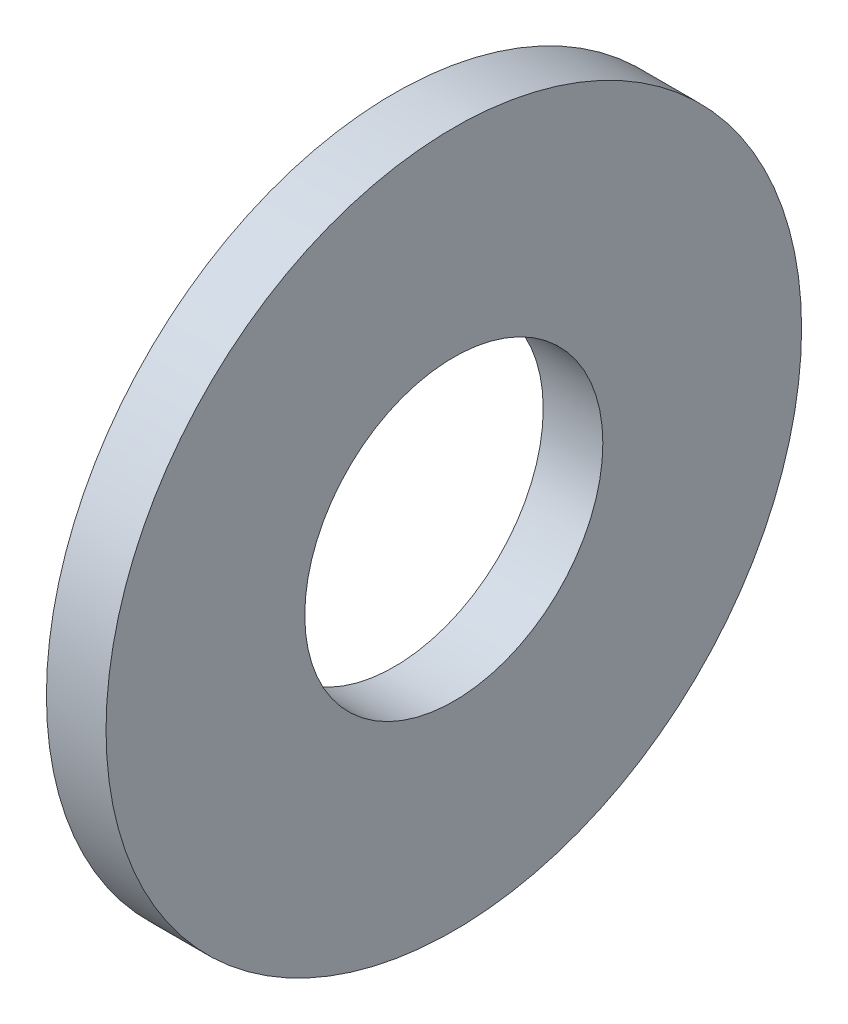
from build123d import *

# Parameters (mm, degrees)
SKETCH1_R           = 11.1125
SKETCH1_R_2         = 4.7625
BOSS_EXTRUDE1_DEPTH = 1.905


with BuildPart() as part:
    # Sketch1 → Boss-Extrude1 (new body)
    with BuildSketch(Plane(origin=(0, 0, 0), x_dir=(0, 0, -1), z_dir=(1, 0, 0))):
        with Locations(Location((0, 0, 0), (0, 0, 180))):
            Circle(SKETCH1_R)
        with Locations(Location((0, 0, 0), (0, 0, 180))):
            Circle(SKETCH1_R_2, mode=Mode.SUBTRACT)
    extrude(amount=BOSS_EXTRUDE1_DEPTH)


solid = part.part
